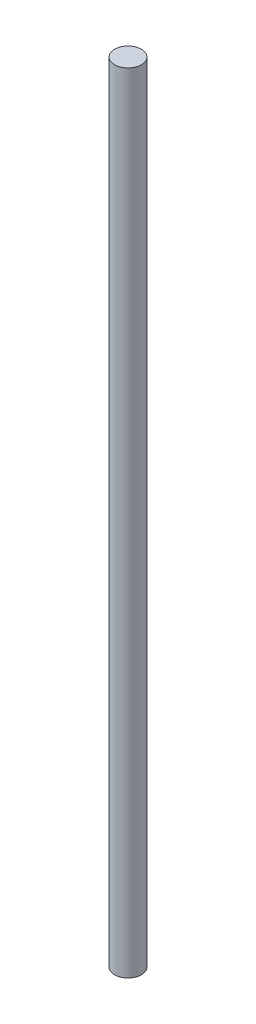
from build123d import *

# Parameters (mm, degrees)
SKETCH1_R      = 4.7625
EXTRUDE1_DEPTH = 279.4


with BuildPart() as part:
    # Sketch1 → Extrude1 (new body)
    with BuildSketch(Plane(origin=(0, 0, 0), x_dir=(1, 0, 0), z_dir=(0, 1, 0))):
        with Locations(Location((0, 0, 0), (0, 0, 270))):
            Circle(SKETCH1_R)
    extrude(amount=EXTRUDE1_DEPTH)


solid = part.part
